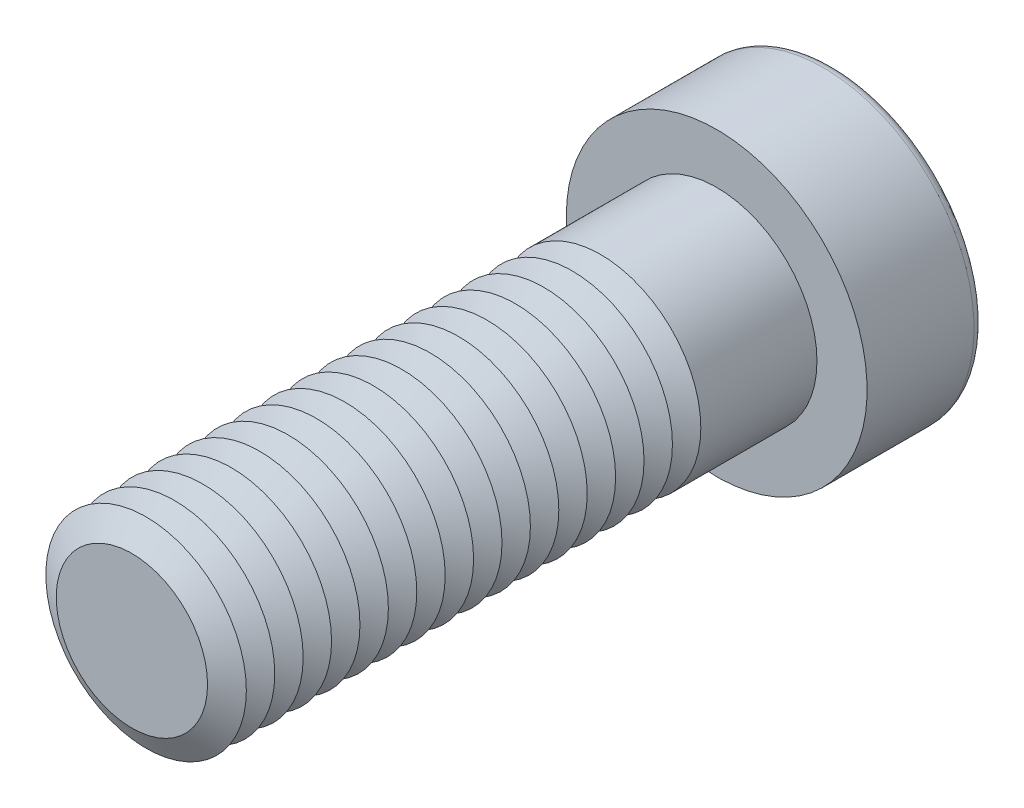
from build123d import *

# Parameters (mm, degrees)
SKETCH1_R           = 6
BOSS_EXTRUDE1_DEPTH = 35
SKETCH2_R           = 9
BOSS_EXTRUDE2_DEPTH = 7
CUT_EXTRUDE1_DEPTH  = 6
FILLET1_R           = 0.6
LPATTERN1_COUNT     = 17
LPATTERN1_PITCH     = 1.7


with BuildPart() as part:
    # Sketch1 → Boss-Extrude1 (new body)
    with BuildSketch(Plane.XY):
        Circle(SKETCH1_R)
    extrude(amount=BOSS_EXTRUDE1_DEPTH)

    # Sketch2 → Boss-Extrude2 (add)
    with BuildSketch(Plane(origin=(0, 0, 0), x_dir=(-1, 0, 0), z_dir=(0, 0, -1))):
        Circle(SKETCH2_R)
    extrude(amount=BOSS_EXTRUDE2_DEPTH)

    # Sketch3 → Cut-Extrude1 (cut)
    with BuildSketch(Plane(origin=(0, 0, -7), x_dir=(-1, 0, 0), z_dir=(0, 0, -1))):
        Polygon((-2.309401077, 4), (-4.618802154, 0), (-2.309401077, -4), (2.309401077, -4), (4.618802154, 0), (2.309401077, 4), align=None)
    extrude(amount=-CUT_EXTRUDE1_DEPTH, mode=Mode.SUBTRACT)

    # Fillet1
    fillet1_edges = [part.edges().sort_by_distance(p)[0] for p in [
        (9, 0, -7),
    ]]
    fillet(fillet1_edges, radius=FILLET1_R)

    # Cut-Extrude2 cone 1 section (on through the dimple's axis) → Cut-Extrude2 (revolve, cut)
    with BuildSketch(Plane(origin=(0, 0, -1), x_dir=(0, 1, 0), z_dir=(1, 0, 0))):
        Polygon((0, 0), (4, 0), (0, 2.309401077), align=None)
    revolve(axis=Axis((0, 0, -1), (0, 0, 1)), mode=Mode.SUBTRACT)

    # Cut-Extrude3 cone 1 section (on through the dimple's axis) → Cut-Extrude3 (revolve, cut)
    with BuildSketch(Plane(origin=(0, 0, -7), x_dir=(0, 1, 0), z_dir=(1, 0, 0))):
        Polygon((0, 0), (4.618802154, 0), (0, 1.237604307), align=None)
    revolve(axis=Axis((0, 0, -7), (0, 0, 1)), mode=Mode.SUBTRACT)

    # Sketch7 → Cut-Revolve1 (revolve, cut)
    with BuildSketch(Plane(origin=(0, 0, 0), x_dir=(0, 0, -1), z_dir=(1, 0, 0)), mode=Mode.PRIVATE) as cut_revolve1_sk:
        Polygon((-35, 4.527756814), (-34.15, 6), (-35.85, 6), align=None)
    cut_revolve1 = revolve(cut_revolve1_sk.sketch.rotate(Axis((0, 0, 35), (0, 0, -1)), 90), axis=Axis((0, 0, 35), (0, 0, -1)), mode=Mode.SUBTRACT)

    # LPattern1: Cut-Revolve1 ×17
    with Locations(*[(0, 0, -i * LPATTERN1_PITCH) for i in range(1, LPATTERN1_COUNT)]):
        add(cut_revolve1, mode=Mode.SUBTRACT)


solid = part.part
